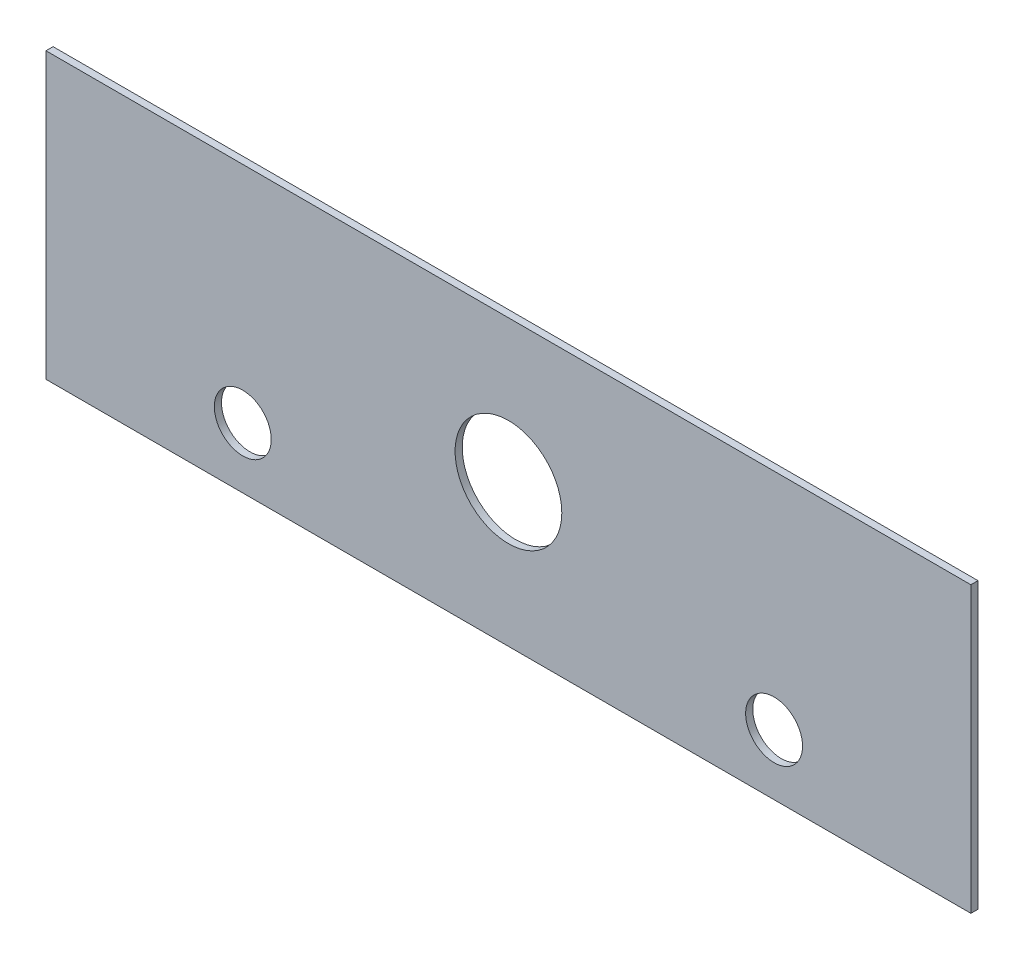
ISO-10303-21;
HEADER;
FILE_DESCRIPTION(('STEP AP214'),'2;1');
FILE_NAME('part.step','',(''),(''),'','','');
FILE_SCHEMA(('AUTOMOTIVE_DESIGN { 1 0 10303 214 1 1 1 1 }'));
ENDSEC;
DATA;
#1=APPLICATION_CONTEXT('core data for automotive mechanical design processes');
#2=APPLICATION_PROTOCOL_DEFINITION('international standard','automotive_design',2000,#1);
#3=PRODUCT_CONTEXT('',#1,'mechanical');
#4=PRODUCT('Part','Part','',(#3));
#5=PRODUCT_RELATED_PRODUCT_CATEGORY('part','',(#4));
#6=PRODUCT_DEFINITION_FORMATION('','',#4);
#7=PRODUCT_DEFINITION_CONTEXT('part definition',#1,'design');
#8=PRODUCT_DEFINITION('design','',#6,#7);
#9=PRODUCT_DEFINITION_SHAPE('','',#8);
#10=(LENGTH_UNIT() NAMED_UNIT(*) SI_UNIT(.MILLI.,.METRE.));
#11=(NAMED_UNIT(*) PLANE_ANGLE_UNIT() SI_UNIT($,.RADIAN.));
#12=(NAMED_UNIT(*) SI_UNIT($,.STERADIAN.) SOLID_ANGLE_UNIT());
#13=UNCERTAINTY_MEASURE_WITH_UNIT(LENGTH_MEASURE(1.E-05),#10,'distance_accuracy_value','');
#14=(GEOMETRIC_REPRESENTATION_CONTEXT(3) GLOBAL_UNCERTAINTY_ASSIGNED_CONTEXT((#13)) GLOBAL_UNIT_ASSIGNED_CONTEXT((#10,
#11,#12)) REPRESENTATION_CONTEXT('',''));
#15=CARTESIAN_POINT('',(0.,0.,0.));
#16=DIRECTION('',(0.,0.,1.));
#17=DIRECTION('',(1.,0.,0.));
#18=AXIS2_PLACEMENT_3D('',#15,#16,#17);
#19=CARTESIAN_POINT('',(0.,0.,1.));
#20=DIRECTION('',(0.,0.,-1.));
#21=DIRECTION('',(-1.,0.,0.));
#22=AXIS2_PLACEMENT_3D('',#19,#20,#21);
#23=PLANE('',#22);
#24=DIRECTION('',(0.,1.,0.));
#25=VECTOR('',#24,1.);
#26=CARTESIAN_POINT('',(65.,-20.,1.));
#27=LINE('',#26,#25);
#28=CARTESIAN_POINT('',(65.,-20.,1.));
#29=VERTEX_POINT('',#28);
#30=CARTESIAN_POINT('',(65.,20.,1.));
#31=VERTEX_POINT('',#30);
#32=EDGE_CURVE('E89',#29,#31,#27,.T.);
#33=ORIENTED_EDGE('',*,*,#32,.T.);
#34=DIRECTION('',(-1.,0.,0.));
#35=VECTOR('',#34,1.);
#36=CARTESIAN_POINT('',(-65.,20.,1.));
#37=LINE('',#36,#35);
#38=CARTESIAN_POINT('',(-65.,20.,1.));
#39=VERTEX_POINT('',#38);
#40=EDGE_CURVE('E84',#31,#39,#37,.T.);
#41=ORIENTED_EDGE('',*,*,#40,.T.);
#42=DIRECTION('',(0.,-1.,0.));
#43=VECTOR('',#42,1.);
#44=CARTESIAN_POINT('',(-65.,-20.,1.));
#45=LINE('',#44,#43);
#46=CARTESIAN_POINT('',(-65.,-20.,1.));
#47=VERTEX_POINT('',#46);
#48=EDGE_CURVE('E87',#39,#47,#45,.T.);
#49=ORIENTED_EDGE('',*,*,#48,.T.);
#50=DIRECTION('',(1.,0.,0.));
#51=VECTOR('',#50,1.);
#52=CARTESIAN_POINT('',(-65.,-20.,1.));
#53=LINE('',#52,#51);
#54=EDGE_CURVE('E54',#47,#29,#53,.T.);
#55=ORIENTED_EDGE('',*,*,#54,.T.);
#56=EDGE_LOOP('',(#33,#41,#49,#55));
#57=FACE_BOUND('',#56,.T.);
#58=CARTESIAN_POINT('',(0.,0.,1.));
#59=DIRECTION('',(0.,0.,1.));
#60=DIRECTION('',(1.,0.,0.));
#61=AXIS2_PLACEMENT_3D('',#58,#59,#60);
#62=CIRCLE('',#61,7.5);
#63=CARTESIAN_POINT('',(7.5,0.,1.));
#64=VERTEX_POINT('',#63);
#65=EDGE_CURVE('E104',#64,#64,#62,.T.);
#66=ORIENTED_EDGE('',*,*,#65,.F.);
#67=EDGE_LOOP('',(#66));
#68=FACE_BOUND('',#67,.T.);
#69=CARTESIAN_POINT('',(-37.3410047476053,-11.4895399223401,1.));
#70=DIRECTION('',(0.,0.,1.));
#71=DIRECTION('',(1.,0.,0.));
#72=AXIS2_PLACEMENT_3D('',#69,#70,#71);
#73=CIRCLE('',#72,4.00000000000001);
#74=CARTESIAN_POINT('',(-33.3410047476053,-11.4895399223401,1.));
#75=VERTEX_POINT('',#74);
#76=EDGE_CURVE('E119',#75,#75,#73,.T.);
#77=ORIENTED_EDGE('',*,*,#76,.F.);
#78=EDGE_LOOP('',(#77));
#79=FACE_BOUND('',#78,.T.);
#80=CARTESIAN_POINT('',(37.3410047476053,-11.4895399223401,1.));
#81=DIRECTION('',(0.,0.,1.));
#82=DIRECTION('',(1.,0.,0.));
#83=AXIS2_PLACEMENT_3D('',#80,#81,#82);
#84=CIRCLE('',#83,4.);
#85=CARTESIAN_POINT('',(41.3410047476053,-11.4895399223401,1.));
#86=VERTEX_POINT('',#85);
#87=EDGE_CURVE('E125',#86,#86,#84,.T.);
#88=ORIENTED_EDGE('',*,*,#87,.F.);
#89=EDGE_LOOP('',(#88));
#90=FACE_BOUND('',#89,.T.);
#91=ADVANCED_FACE('F37',(#57,#68,#79,#90),#23,.F.);
#92=CARTESIAN_POINT('',(0.,0.,0.));
#93=DIRECTION('',(0.,0.,-1.));
#94=DIRECTION('',(-1.,0.,0.));
#95=AXIS2_PLACEMENT_3D('',#92,#93,#94);
#96=PLANE('',#95);
#97=CARTESIAN_POINT('',(-37.3410047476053,-11.4895399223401,0.));
#98=DIRECTION('',(0.,0.,1.));
#99=DIRECTION('',(1.,0.,0.));
#100=AXIS2_PLACEMENT_3D('',#97,#98,#99);
#101=CIRCLE('',#100,4.00000000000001);
#102=CARTESIAN_POINT('',(-33.3410047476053,-11.4895399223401,0.));
#103=VERTEX_POINT('',#102);
#104=EDGE_CURVE('E122',#103,#103,#101,.T.);
#105=ORIENTED_EDGE('',*,*,#104,.T.);
#106=EDGE_LOOP('',(#105));
#107=FACE_BOUND('',#106,.T.);
#108=DIRECTION('',(0.,1.,0.));
#109=VECTOR('',#108,1.);
#110=CARTESIAN_POINT('',(65.,-20.,0.));
#111=LINE('',#110,#109);
#112=CARTESIAN_POINT('',(65.,-20.,0.));
#113=VERTEX_POINT('',#112);
#114=CARTESIAN_POINT('',(65.,20.,0.));
#115=VERTEX_POINT('',#114);
#116=EDGE_CURVE('E101',#113,#115,#111,.T.);
#117=ORIENTED_EDGE('',*,*,#116,.F.);
#118=DIRECTION('',(1.,0.,0.));
#119=VECTOR('',#118,1.);
#120=CARTESIAN_POINT('',(-65.,-20.,0.));
#121=LINE('',#120,#119);
#122=CARTESIAN_POINT('',(-65.,-20.,0.));
#123=VERTEX_POINT('',#122);
#124=EDGE_CURVE('E77',#123,#113,#121,.T.);
#125=ORIENTED_EDGE('',*,*,#124,.F.);
#126=DIRECTION('',(0.,-1.,0.));
#127=VECTOR('',#126,1.);
#128=CARTESIAN_POINT('',(-65.,-20.,0.));
#129=LINE('',#128,#127);
#130=CARTESIAN_POINT('',(-65.,20.,0.));
#131=VERTEX_POINT('',#130);
#132=EDGE_CURVE('E71',#131,#123,#129,.T.);
#133=ORIENTED_EDGE('',*,*,#132,.F.);
#134=DIRECTION('',(-1.,0.,0.));
#135=VECTOR('',#134,1.);
#136=CARTESIAN_POINT('',(-65.,20.,0.));
#137=LINE('',#136,#135);
#138=EDGE_CURVE('E93',#115,#131,#137,.T.);
#139=ORIENTED_EDGE('',*,*,#138,.F.);
#140=EDGE_LOOP('',(#117,#125,#133,#139));
#141=FACE_BOUND('',#140,.T.);
#142=CARTESIAN_POINT('',(0.,0.,0.));
#143=DIRECTION('',(0.,0.,1.));
#144=DIRECTION('',(1.,0.,0.));
#145=AXIS2_PLACEMENT_3D('',#142,#143,#144);
#146=CIRCLE('',#145,7.5);
#147=CARTESIAN_POINT('',(7.5,0.,0.));
#148=VERTEX_POINT('',#147);
#149=EDGE_CURVE('E116',#148,#148,#146,.T.);
#150=ORIENTED_EDGE('',*,*,#149,.T.);
#151=EDGE_LOOP('',(#150));
#152=FACE_BOUND('',#151,.T.);
#153=CARTESIAN_POINT('',(37.3410047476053,-11.4895399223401,0.));
#154=DIRECTION('',(0.,0.,1.));
#155=DIRECTION('',(1.,0.,0.));
#156=AXIS2_PLACEMENT_3D('',#153,#154,#155);
#157=CIRCLE('',#156,4.);
#158=CARTESIAN_POINT('',(41.3410047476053,-11.4895399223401,0.));
#159=VERTEX_POINT('',#158);
#160=EDGE_CURVE('E128',#159,#159,#157,.T.);
#161=ORIENTED_EDGE('',*,*,#160,.T.);
#162=EDGE_LOOP('',(#161));
#163=FACE_BOUND('',#162,.T.);
#164=ADVANCED_FACE('F112',(#107,#141,#152,#163),#96,.T.);
#165=CARTESIAN_POINT('',(65.,-20.,1.));
#166=DIRECTION('',(-1.,0.,0.));
#167=DIRECTION('',(0.,0.,1.));
#168=AXIS2_PLACEMENT_3D('',#165,#166,#167);
#169=PLANE('',#168);
#170=ORIENTED_EDGE('',*,*,#116,.T.);
#171=DIRECTION('',(0.,0.,-1.));
#172=VECTOR('',#171,1.);
#173=CARTESIAN_POINT('',(65.,20.,1.));
#174=LINE('',#173,#172);
#175=EDGE_CURVE('E11',#31,#115,#174,.T.);
#176=ORIENTED_EDGE('',*,*,#175,.F.);
#177=ORIENTED_EDGE('',*,*,#32,.F.);
#178=DIRECTION('',(0.,0.,-1.));
#179=VECTOR('',#178,1.);
#180=CARTESIAN_POINT('',(65.,-20.,1.));
#181=LINE('',#180,#179);
#182=EDGE_CURVE('E97',#29,#113,#181,.T.);
#183=ORIENTED_EDGE('',*,*,#182,.T.);
#184=EDGE_LOOP('',(#170,#176,#177,#183));
#185=FACE_BOUND('',#184,.T.);
#186=ADVANCED_FACE('F39',(#185),#169,.F.);
#187=CARTESIAN_POINT('',(-65.,20.,1.));
#188=DIRECTION('',(0.,-1.,0.));
#189=DIRECTION('',(0.,0.,-1.));
#190=AXIS2_PLACEMENT_3D('',#187,#188,#189);
#191=PLANE('',#190);
#192=ORIENTED_EDGE('',*,*,#138,.T.);
#193=DIRECTION('',(0.,0.,-1.));
#194=VECTOR('',#193,1.);
#195=CARTESIAN_POINT('',(-65.,20.,1.));
#196=LINE('',#195,#194);
#197=EDGE_CURVE('E46',#39,#131,#196,.T.);
#198=ORIENTED_EDGE('',*,*,#197,.F.);
#199=ORIENTED_EDGE('',*,*,#40,.F.);
#200=ORIENTED_EDGE('',*,*,#175,.T.);
#201=EDGE_LOOP('',(#192,#198,#199,#200));
#202=FACE_BOUND('',#201,.T.);
#203=ADVANCED_FACE('F92',(#202),#191,.F.);
#204=CARTESIAN_POINT('',(-65.,-20.,1.));
#205=DIRECTION('',(1.,0.,0.));
#206=DIRECTION('',(0.,0.,-1.));
#207=AXIS2_PLACEMENT_3D('',#204,#205,#206);
#208=PLANE('',#207);
#209=ORIENTED_EDGE('',*,*,#132,.T.);
#210=DIRECTION('',(0.,0.,-1.));
#211=VECTOR('',#210,1.);
#212=CARTESIAN_POINT('',(-65.,-20.,1.));
#213=LINE('',#212,#211);
#214=EDGE_CURVE('E94',#47,#123,#213,.T.);
#215=ORIENTED_EDGE('',*,*,#214,.F.);
#216=ORIENTED_EDGE('',*,*,#48,.F.);
#217=ORIENTED_EDGE('',*,*,#197,.T.);
#218=EDGE_LOOP('',(#209,#215,#216,#217));
#219=FACE_BOUND('',#218,.T.);
#220=ADVANCED_FACE('F95',(#219),#208,.F.);
#221=CARTESIAN_POINT('',(-65.,-20.,1.));
#222=DIRECTION('',(0.,1.,0.));
#223=DIRECTION('',(0.,0.,1.));
#224=AXIS2_PLACEMENT_3D('',#221,#222,#223);
#225=PLANE('',#224);
#226=ORIENTED_EDGE('',*,*,#124,.T.);
#227=ORIENTED_EDGE('',*,*,#182,.F.);
#228=ORIENTED_EDGE('',*,*,#54,.F.);
#229=ORIENTED_EDGE('',*,*,#214,.T.);
#230=EDGE_LOOP('',(#226,#227,#228,#229));
#231=FACE_BOUND('',#230,.T.);
#232=ADVANCED_FACE('F109',(#231),#225,.F.);
#233=CARTESIAN_POINT('',(0.,0.,1.));
#234=DIRECTION('',(0.,0.,-1.));
#235=DIRECTION('',(-1.,0.,0.));
#236=AXIS2_PLACEMENT_3D('',#233,#234,#235);
#237=CYLINDRICAL_SURFACE('',#236,7.5);
#238=ORIENTED_EDGE('',*,*,#65,.T.);
#239=EDGE_LOOP('',(#238));
#240=FACE_BOUND('',#239,.T.);
#241=ORIENTED_EDGE('',*,*,#149,.F.);
#242=EDGE_LOOP('',(#241));
#243=FACE_BOUND('',#242,.T.);
#244=ADVANCED_FACE('F145',(#240,#243),#237,.F.);
#245=CARTESIAN_POINT('',(-37.3410047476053,-11.4895399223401,1.));
#246=DIRECTION('',(0.,0.,-1.));
#247=DIRECTION('',(-1.,0.,0.));
#248=AXIS2_PLACEMENT_3D('',#245,#246,#247);
#249=CYLINDRICAL_SURFACE('',#248,4.00000000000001);
#250=ORIENTED_EDGE('',*,*,#76,.T.);
#251=EDGE_LOOP('',(#250));
#252=FACE_BOUND('',#251,.T.);
#253=ORIENTED_EDGE('',*,*,#104,.F.);
#254=EDGE_LOOP('',(#253));
#255=FACE_BOUND('',#254,.T.);
#256=ADVANCED_FACE('F191',(#252,#255),#249,.F.);
#257=CARTESIAN_POINT('',(37.3410047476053,-11.4895399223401,1.));
#258=DIRECTION('',(0.,0.,-1.));
#259=DIRECTION('',(-1.,0.,0.));
#260=AXIS2_PLACEMENT_3D('',#257,#258,#259);
#261=CYLINDRICAL_SURFACE('',#260,4.);
#262=ORIENTED_EDGE('',*,*,#87,.T.);
#263=EDGE_LOOP('',(#262));
#264=FACE_BOUND('',#263,.T.);
#265=ORIENTED_EDGE('',*,*,#160,.F.);
#266=EDGE_LOOP('',(#265));
#267=FACE_BOUND('',#266,.T.);
#268=ADVANCED_FACE('F134',(#264,#267),#261,.F.);
#269=CLOSED_SHELL('',(#91,#164,#186,#203,#220,#232,#244,#256,#268));
#270=MANIFOLD_SOLID_BREP('B2',#269);
#271=ADVANCED_BREP_SHAPE_REPRESENTATION('',(#18,#270),#14);
#272=SHAPE_DEFINITION_REPRESENTATION(#9,#271);
ENDSEC;
END-ISO-10303-21;
